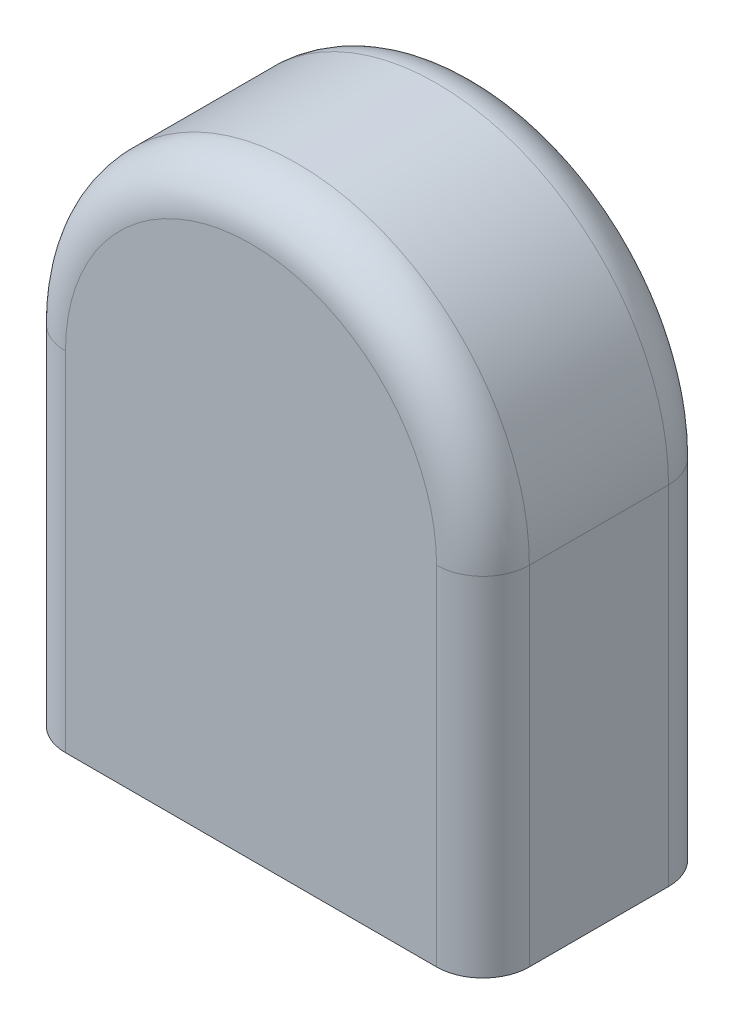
from build123d import *

# Parameters (mm, degrees)
BASE_EXTRUDE_DEPTH = 3.175
SKETCH2_R          = 3.175
CUT_EXTRUDE1_DEPTH = 3.175
FILLET1_R          = 1.27
FILLET2_R          = 0.635


with BuildPart() as part:
    # Sketch1 → Base-Extrude (new, symmetric)
    with BuildSketch(Plane.XY):
        with BuildLine():
            Line((-6.35, 0), (6.35, 0))
            Line((6.35, 0), (6.35, 9.525))
            ThreePointArc((6.35, 9.525), (0, 15.875), (-6.35, 9.525))
            Line((-6.35, 9.525), (-6.35, 0))
        make_face()
    extrude(amount=BASE_EXTRUDE_DEPTH, both=True)

    # Sketch2 → Cut-Extrude1 (cut)
    with BuildSketch(Plane(origin=(0, 0, -3.175), x_dir=(-1, 0, 0), z_dir=(0, 0, -1))):
        with Locations((0, 9.525)):
            Circle(SKETCH2_R)
    extrude(amount=-CUT_EXTRUDE1_DEPTH, mode=Mode.SUBTRACT)

    # Fillet1
    fillet1_edges = [part.edges().sort_by_distance(p)[0] for p in [
        (6.35, 4.7625, 3.175),
        (0, 15.875, 3.175),
        (-6.35, 4.7625, 3.175),
        (0, 15.875, -3.175),
        (6.35, 4.7625, -3.175),
        (-6.35, 4.7625, -3.175),
    ]]
    fillet(fillet1_edges, radius=FILLET1_R)

    # Fillet2
    fillet2_edges = [part.edges().sort_by_distance(p)[0] for p in [
        (3.175, 9.525, 0),
        (3.175, 9.525, -3.175),
    ]]
    fillet(fillet2_edges, radius=FILLET2_R)


solid = part.part
